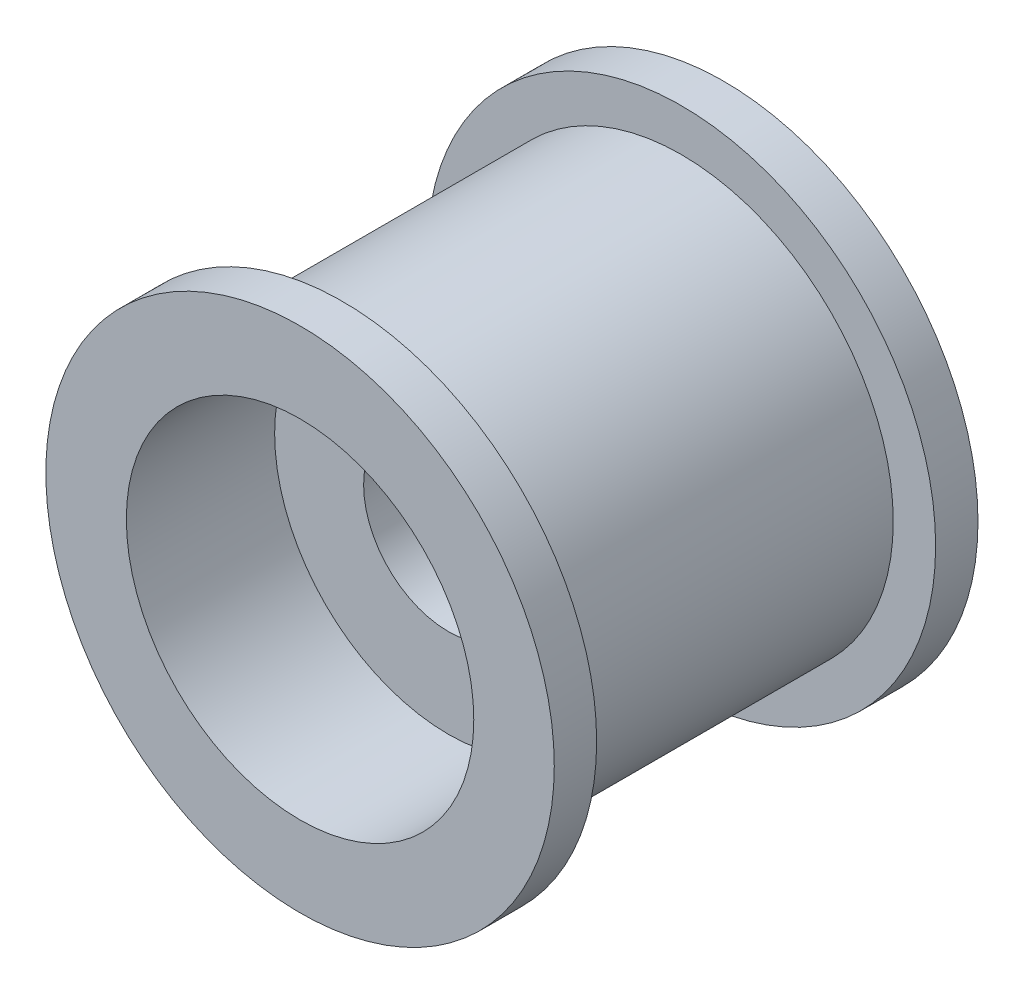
ISO-10303-21;
HEADER;
FILE_DESCRIPTION(('STEP AP214'),'2;1');
FILE_NAME('part.step','',(''),(''),'','','');
FILE_SCHEMA(('AUTOMOTIVE_DESIGN { 1 0 10303 214 1 1 1 1 }'));
ENDSEC;
DATA;
#1=APPLICATION_CONTEXT('core data for automotive mechanical design processes');
#2=APPLICATION_PROTOCOL_DEFINITION('international standard','automotive_design',2000,#1);
#3=PRODUCT_CONTEXT('',#1,'mechanical');
#4=PRODUCT('Part','Part','',(#3));
#5=PRODUCT_RELATED_PRODUCT_CATEGORY('part','',(#4));
#6=PRODUCT_DEFINITION_FORMATION('','',#4);
#7=PRODUCT_DEFINITION_CONTEXT('part definition',#1,'design');
#8=PRODUCT_DEFINITION('design','',#6,#7);
#9=PRODUCT_DEFINITION_SHAPE('','',#8);
#10=(LENGTH_UNIT() NAMED_UNIT(*) SI_UNIT(.MILLI.,.METRE.));
#11=(NAMED_UNIT(*) PLANE_ANGLE_UNIT() SI_UNIT($,.RADIAN.));
#12=(NAMED_UNIT(*) SI_UNIT($,.STERADIAN.) SOLID_ANGLE_UNIT());
#13=UNCERTAINTY_MEASURE_WITH_UNIT(LENGTH_MEASURE(1.E-05),#10,'distance_accuracy_value','');
#14=(GEOMETRIC_REPRESENTATION_CONTEXT(3) GLOBAL_UNCERTAINTY_ASSIGNED_CONTEXT((#13)) GLOBAL_UNIT_ASSIGNED_CONTEXT((#10,
#11,#12)) REPRESENTATION_CONTEXT('',''));
#15=CARTESIAN_POINT('',(0.,0.,0.));
#16=DIRECTION('',(0.,0.,1.));
#17=DIRECTION('',(1.,0.,0.));
#18=AXIS2_PLACEMENT_3D('',#15,#16,#17);
#19=CARTESIAN_POINT('',(0.,0.,10.));
#20=DIRECTION('',(0.,0.,-1.));
#21=DIRECTION('',(-1.,0.,0.));
#22=AXIS2_PLACEMENT_3D('',#19,#20,#21);
#23=CYLINDRICAL_SURFACE('',#22,6.);
#24=CARTESIAN_POINT('',(0.,0.,0.));
#25=DIRECTION('',(0.,0.,1.));
#26=DIRECTION('',(1.,0.,0.));
#27=AXIS2_PLACEMENT_3D('',#24,#25,#26);
#28=CIRCLE('',#27,6.);
#29=CARTESIAN_POINT('',(6.,0.,0.));
#30=VERTEX_POINT('',#29);
#31=EDGE_CURVE('E39',#30,#30,#28,.T.);
#32=ORIENTED_EDGE('',*,*,#31,.T.);
#33=EDGE_LOOP('',(#32));
#34=FACE_BOUND('',#33,.T.);
#35=CARTESIAN_POINT('',(0.,0.,1.));
#36=DIRECTION('',(0.,0.,1.));
#37=DIRECTION('',(1.,0.,0.));
#38=AXIS2_PLACEMENT_3D('',#35,#36,#37);
#39=CIRCLE('',#38,6.);
#40=CARTESIAN_POINT('',(6.,0.,1.));
#41=VERTEX_POINT('',#40);
#42=EDGE_CURVE('E46',#41,#41,#39,.T.);
#43=ORIENTED_EDGE('',*,*,#42,.F.);
#44=EDGE_LOOP('',(#43));
#45=FACE_BOUND('',#44,.T.);
#46=ADVANCED_FACE('F35',(#34,#45),#23,.T.);
#47=CARTESIAN_POINT('',(0.,0.,0.));
#48=DIRECTION('',(0.,0.,1.));
#49=DIRECTION('',(1.,0.,0.));
#50=AXIS2_PLACEMENT_3D('',#47,#48,#49);
#51=PLANE('',#50);
#52=CARTESIAN_POINT('',(0.,0.,0.));
#53=DIRECTION('',(0.,0.,1.));
#54=DIRECTION('',(1.,0.,0.));
#55=AXIS2_PLACEMENT_3D('',#52,#53,#54);
#56=CIRCLE('',#55,4.1);
#57=CARTESIAN_POINT('',(4.1,0.,0.));
#58=VERTEX_POINT('',#57);
#59=EDGE_CURVE('E66',#58,#58,#56,.T.);
#60=ORIENTED_EDGE('',*,*,#59,.T.);
#61=EDGE_LOOP('',(#60));
#62=FACE_BOUND('',#61,.T.);
#63=ORIENTED_EDGE('',*,*,#31,.F.);
#64=EDGE_LOOP('',(#63));
#65=FACE_BOUND('',#64,.T.);
#66=ADVANCED_FACE('F93',(#62,#65),#51,.F.);
#67=CARTESIAN_POINT('',(0.,0.,1.));
#68=DIRECTION('',(0.,0.,1.));
#69=DIRECTION('',(1.,0.,0.));
#70=AXIS2_PLACEMENT_3D('',#67,#68,#69);
#71=PLANE('',#70);
#72=CARTESIAN_POINT('',(0.,0.,1.));
#73=DIRECTION('',(0.,0.,1.));
#74=DIRECTION('',(1.,0.,0.));
#75=AXIS2_PLACEMENT_3D('',#72,#73,#74);
#76=CIRCLE('',#75,5.);
#77=CARTESIAN_POINT('',(5.,0.,1.));
#78=VERTEX_POINT('',#77);
#79=EDGE_CURVE('E51',#78,#78,#76,.T.);
#80=ORIENTED_EDGE('',*,*,#79,.F.);
#81=EDGE_LOOP('',(#80));
#82=FACE_BOUND('',#81,.T.);
#83=ORIENTED_EDGE('',*,*,#42,.T.);
#84=EDGE_LOOP('',(#83));
#85=FACE_BOUND('',#84,.T.);
#86=ADVANCED_FACE('F96',(#82,#85),#71,.T.);
#87=CARTESIAN_POINT('',(0.,0.,9.));
#88=DIRECTION('',(0.,0.,1.));
#89=DIRECTION('',(1.,0.,0.));
#90=AXIS2_PLACEMENT_3D('',#87,#88,#89);
#91=PLANE('',#90);
#92=CARTESIAN_POINT('',(0.,0.,9.));
#93=DIRECTION('',(0.,0.,1.));
#94=DIRECTION('',(1.,0.,0.));
#95=AXIS2_PLACEMENT_3D('',#92,#93,#94);
#96=CIRCLE('',#95,5.);
#97=CARTESIAN_POINT('',(5.,0.,9.));
#98=VERTEX_POINT('',#97);
#99=EDGE_CURVE('E54',#98,#98,#96,.T.);
#100=ORIENTED_EDGE('',*,*,#99,.T.);
#101=EDGE_LOOP('',(#100));
#102=FACE_BOUND('',#101,.T.);
#103=CARTESIAN_POINT('',(0.,0.,9.));
#104=DIRECTION('',(0.,0.,1.));
#105=DIRECTION('',(1.,0.,0.));
#106=AXIS2_PLACEMENT_3D('',#103,#104,#105);
#107=CIRCLE('',#106,6.);
#108=CARTESIAN_POINT('',(6.,0.,9.));
#109=VERTEX_POINT('',#108);
#110=EDGE_CURVE('E48',#109,#109,#107,.T.);
#111=ORIENTED_EDGE('',*,*,#110,.F.);
#112=EDGE_LOOP('',(#111));
#113=FACE_BOUND('',#112,.T.);
#114=ADVANCED_FACE('F104',(#102,#113),#91,.F.);
#115=CARTESIAN_POINT('',(0.,0.,1.));
#116=DIRECTION('',(0.,0.,1.));
#117=DIRECTION('',(1.,0.,0.));
#118=AXIS2_PLACEMENT_3D('',#115,#116,#117);
#119=CYLINDRICAL_SURFACE('',#118,5.);
#120=ORIENTED_EDGE('',*,*,#79,.T.);
#121=EDGE_LOOP('',(#120));
#122=FACE_BOUND('',#121,.T.);
#123=ORIENTED_EDGE('',*,*,#99,.F.);
#124=EDGE_LOOP('',(#123));
#125=FACE_BOUND('',#124,.T.);
#126=ADVANCED_FACE('F110',(#122,#125),#119,.T.);
#127=CARTESIAN_POINT('',(0.,0.,10.));
#128=DIRECTION('',(0.,0.,1.));
#129=DIRECTION('',(1.,0.,0.));
#130=AXIS2_PLACEMENT_3D('',#127,#128,#129);
#131=PLANE('',#130);
#132=CARTESIAN_POINT('',(0.,0.,10.));
#133=DIRECTION('',(0.,0.,1.));
#134=DIRECTION('',(1.,0.,0.));
#135=AXIS2_PLACEMENT_3D('',#132,#133,#134);
#136=CIRCLE('',#135,4.1);
#137=CARTESIAN_POINT('',(4.1,0.,10.));
#138=VERTEX_POINT('',#137);
#139=EDGE_CURVE('E60',#138,#138,#136,.T.);
#140=ORIENTED_EDGE('',*,*,#139,.F.);
#141=EDGE_LOOP('',(#140));
#142=FACE_BOUND('',#141,.T.);
#143=CARTESIAN_POINT('',(0.,0.,10.));
#144=DIRECTION('',(0.,0.,1.));
#145=DIRECTION('',(1.,0.,0.));
#146=AXIS2_PLACEMENT_3D('',#143,#144,#145);
#147=CIRCLE('',#146,6.);
#148=CARTESIAN_POINT('',(6.,0.,10.));
#149=VERTEX_POINT('',#148);
#150=EDGE_CURVE('E10',#149,#149,#147,.T.);
#151=ORIENTED_EDGE('',*,*,#150,.T.);
#152=EDGE_LOOP('',(#151));
#153=FACE_BOUND('',#152,.T.);
#154=ADVANCED_FACE('F117',(#142,#153),#131,.T.);
#155=ORIENTED_EDGE('',*,*,#110,.T.);
#156=EDGE_LOOP('',(#155));
#157=FACE_BOUND('',#156,.T.);
#158=ORIENTED_EDGE('',*,*,#150,.F.);
#159=EDGE_LOOP('',(#158));
#160=FACE_BOUND('',#159,.T.);
#161=ADVANCED_FACE('F37',(#157,#160),#23,.T.);
#162=CARTESIAN_POINT('',(0.,0.,6.5));
#163=DIRECTION('',(0.,0.,1.));
#164=DIRECTION('',(1.,0.,0.));
#165=AXIS2_PLACEMENT_3D('',#162,#163,#164);
#166=CYLINDRICAL_SURFACE('',#165,4.1);
#167=CARTESIAN_POINT('',(0.,0.,6.5));
#168=DIRECTION('',(0.,0.,1.));
#169=DIRECTION('',(1.,0.,0.));
#170=AXIS2_PLACEMENT_3D('',#167,#168,#169);
#171=CIRCLE('',#170,4.1);
#172=CARTESIAN_POINT('',(4.1,0.,6.5));
#173=VERTEX_POINT('',#172);
#174=EDGE_CURVE('E57',#173,#173,#171,.T.);
#175=ORIENTED_EDGE('',*,*,#174,.F.);
#176=EDGE_LOOP('',(#175));
#177=FACE_BOUND('',#176,.T.);
#178=ORIENTED_EDGE('',*,*,#139,.T.);
#179=EDGE_LOOP('',(#178));
#180=FACE_BOUND('',#179,.T.);
#181=ADVANCED_FACE('F124',(#177,#180),#166,.F.);
#182=CARTESIAN_POINT('',(0.,0.,6.5));
#183=DIRECTION('',(0.,0.,1.));
#184=DIRECTION('',(1.,0.,0.));
#185=AXIS2_PLACEMENT_3D('',#182,#183,#184);
#186=PLANE('',#185);
#187=CARTESIAN_POINT('',(0.,0.,6.5));
#188=DIRECTION('',(0.,0.,1.));
#189=DIRECTION('',(1.,0.,0.));
#190=AXIS2_PLACEMENT_3D('',#187,#188,#189);
#191=CIRCLE('',#190,2.);
#192=CARTESIAN_POINT('',(2.,0.,6.5));
#193=VERTEX_POINT('',#192);
#194=EDGE_CURVE('E69',#193,#193,#191,.T.);
#195=ORIENTED_EDGE('',*,*,#194,.F.);
#196=EDGE_LOOP('',(#195));
#197=FACE_BOUND('',#196,.T.);
#198=ORIENTED_EDGE('',*,*,#174,.T.);
#199=EDGE_LOOP('',(#198));
#200=FACE_BOUND('',#199,.T.);
#201=ADVANCED_FACE('F89',(#197,#200),#186,.T.);
#202=CARTESIAN_POINT('',(0.,0.,3.5));
#203=DIRECTION('',(0.,0.,-1.));
#204=DIRECTION('',(-1.,0.,0.));
#205=AXIS2_PLACEMENT_3D('',#202,#203,#204);
#206=CYLINDRICAL_SURFACE('',#205,4.1);
#207=CARTESIAN_POINT('',(0.,0.,3.5));
#208=DIRECTION('',(0.,0.,1.));
#209=DIRECTION('',(1.,0.,0.));
#210=AXIS2_PLACEMENT_3D('',#207,#208,#209);
#211=CIRCLE('',#210,4.1);
#212=CARTESIAN_POINT('',(4.1,0.,3.5));
#213=VERTEX_POINT('',#212);
#214=EDGE_CURVE('E63',#213,#213,#211,.T.);
#215=ORIENTED_EDGE('',*,*,#214,.T.);
#216=EDGE_LOOP('',(#215));
#217=FACE_BOUND('',#216,.T.);
#218=ORIENTED_EDGE('',*,*,#59,.F.);
#219=EDGE_LOOP('',(#218));
#220=FACE_BOUND('',#219,.T.);
#221=ADVANCED_FACE('F83',(#217,#220),#206,.F.);
#222=CARTESIAN_POINT('',(0.,0.,3.5));
#223=DIRECTION('',(0.,0.,-1.));
#224=DIRECTION('',(1.,0.,0.));
#225=AXIS2_PLACEMENT_3D('',#222,#223,#224);
#226=PLANE('',#225);
#227=CARTESIAN_POINT('',(0.,0.,3.5));
#228=DIRECTION('',(0.,0.,-1.));
#229=DIRECTION('',(-1.,0.,0.));
#230=AXIS2_PLACEMENT_3D('',#227,#228,#229);
#231=CIRCLE('',#230,2.);
#232=CARTESIAN_POINT('',(-2.,0.,3.5));
#233=VERTEX_POINT('',#232);
#234=EDGE_CURVE('E74',#233,#233,#231,.T.);
#235=ORIENTED_EDGE('',*,*,#234,.F.);
#236=EDGE_LOOP('',(#235));
#237=FACE_BOUND('',#236,.T.);
#238=ORIENTED_EDGE('',*,*,#214,.F.);
#239=EDGE_LOOP('',(#238));
#240=FACE_BOUND('',#239,.T.);
#241=ADVANCED_FACE('F80',(#237,#240),#226,.T.);
#242=CARTESIAN_POINT('',(0.,0.,10.));
#243=DIRECTION('',(0.,0.,-1.));
#244=DIRECTION('',(-1.,0.,0.));
#245=AXIS2_PLACEMENT_3D('',#242,#243,#244);
#246=CYLINDRICAL_SURFACE('',#245,2.);
#247=ORIENTED_EDGE('',*,*,#194,.T.);
#248=EDGE_LOOP('',(#247));
#249=FACE_BOUND('',#248,.T.);
#250=ORIENTED_EDGE('',*,*,#234,.T.);
#251=EDGE_LOOP('',(#250));
#252=FACE_BOUND('',#251,.T.);
#253=ADVANCED_FACE('F78',(#249,#252),#246,.F.);
#254=CLOSED_SHELL('',(#46,#66,#86,#114,#126,#154,#161,#181,#201,#221,#241,#253));
#255=MANIFOLD_SOLID_BREP('B2',#254);
#256=ADVANCED_BREP_SHAPE_REPRESENTATION('',(#18,#255),#14);
#257=SHAPE_DEFINITION_REPRESENTATION(#9,#256);
ENDSEC;
END-ISO-10303-21;
